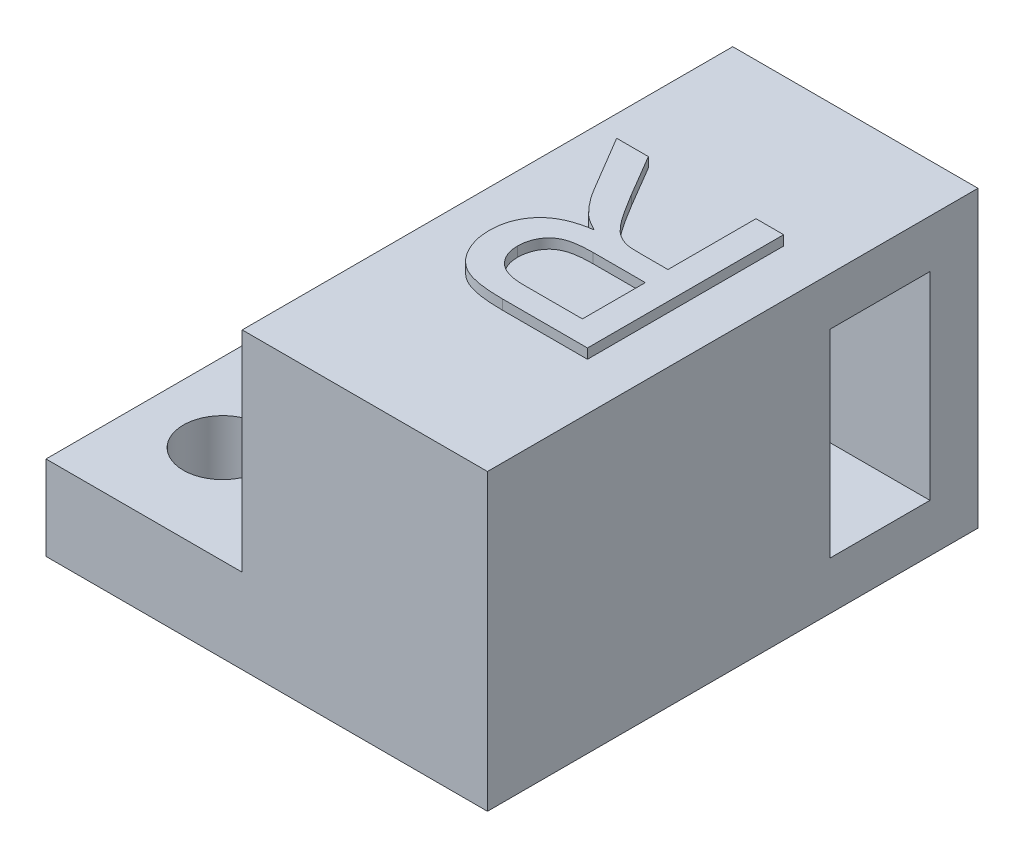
from build123d import *

# Parameters (mm, degrees)
SKETCH1_W           = 25
SKETCH1_H           = 50
BOSS_EXTRUDE1_DEPTH = 30
SKETCH2_W           = 50
SKETCH2_H           = 8.605036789
BOSS_EXTRUDE2_DEPTH = 20
SKETCH3_R           = 4
CUT_EXTRUDE1_DEPTH  = 47.249264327
SKETCH4_W           = 10.2
SKETCH4_H           = 20.2
CUT_EXTRUDE2_DEPTH  = 20
BOSS_EXTRUDE3_DEPTH = 1


with BuildPart() as part:
    # Sketch1 → Boss-Extrude1 (new body)
    with BuildSketch(Plane(origin=(0, 0, 0), x_dir=(1, 0, 0), z_dir=(0, 1, 0))):
        Rectangle(SKETCH1_W, SKETCH1_H)
    extrude(amount=BOSS_EXTRUDE1_DEPTH)

    # Sketch2 → Boss-Extrude2 (add)
    with BuildSketch(Plane.ZY.offset(12.5)):
        with Locations((0, 4.302518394)):
            Rectangle(SKETCH2_W, SKETCH2_H)
    extrude(amount=BOSS_EXTRUDE2_DEPTH)

    # Sketch3 → Cut-Extrude1 (cut, through all)
    with BuildSketch(Plane(origin=(0, 8.605036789, 0), x_dir=(1, 0, 0), z_dir=(0, 1, 0))):
        with Locations(Location((-24.5, 15, 0), (0, 0, 270))):
            Circle(SKETCH3_R)
        with Locations(Location((-24.5, -15, 0), (0, 0, 270))):
            Circle(SKETCH3_R)
    extrude(amount=-CUT_EXTRUDE1_DEPTH, mode=Mode.SUBTRACT)

    # Sketch4 → Cut-Extrude2 (cut)
    with BuildSketch(Plane(origin=(12.5, 0, 0), x_dir=(0, 0, -1), z_dir=(1, 0, 0))):
        with Locations((15, 15)):
            Rectangle(SKETCH4_W, SKETCH4_H)
    extrude(amount=-CUT_EXTRUDE2_DEPTH, mode=Mode.SUBTRACT)

    # Sketch5 → Boss-Extrude3 (add)
    with BuildSketch(Plane(origin=(0, 30, 0), x_dir=(1, 0, 0), z_dir=(0, 1, 0))):
        with BuildLine():
            Line((7.692307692, 10), (7.692307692, -10))
            Line((7.692307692, -10), (-0.985576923, -10))
            add(Edge.make_bspline(
                [(-0.985576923, -10), (-1.189915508, -9.998406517), (-1.585388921, -9.995322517), (-2.158891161, -9.97328499), (-2.692933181, -9.926466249), (-3.190880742, -9.87417544), (-3.651881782, -9.796967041), (-4.076156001, -9.706387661), (-4.462076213, -9.599333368), (-4.812578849, -9.472790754), (-5.13779529, -9.329673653), (-5.439160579, -9.1529927), (-5.729614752, -8.959721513), (-5.997579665, -8.730765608), (-6.255124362, -8.484777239), (-6.491466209, -8.20944831), (-6.713599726, -7.911670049), (-6.98368474, -7.480457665), (-7.26734754, -6.902448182), (-7.511671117, -6.168093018), (-7.667028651, -5.399134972), (-7.683798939, -4.873873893), (-7.692307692, -4.607371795)],
                knots=[0, 0, 0, 0, 1.242075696, 2.40389213, 3.487198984, 4.500157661, 5.446319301, 6.326791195, 7.136300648, 7.878370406, 8.590488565, 9.292260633, 9.999224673, 10.708050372, 11.431369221, 12.162165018, 12.910600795, 13.687589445, 15.252257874, 16.810406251, 18.381693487, 20, 20, 20, 20], degree=3))
            add(Edge.make_bspline(
                [(-7.692307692, -4.607371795), (-7.688394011, -4.436288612), (-7.680664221, -4.098387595), (-7.621454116, -3.601582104), (-7.51431592, -3.126906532), (-7.376939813, -2.670193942), (-7.1888858, -2.237951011), (-6.971132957, -1.821215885), (-6.700987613, -1.431932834), (-6.399355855, -1.057091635), (-6.048612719, -0.71360816), (-5.658467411, -0.39614679), (-5.217190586, -0.123711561), (-4.739255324, 0.129469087), (-4.212344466, 0.337396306), (-3.644404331, 0.520482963), (-3.031039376, 0.661647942), (-2.605906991, 0.732754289), (-2.387820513, 0.769230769)],
                knots=[0, 0, 0, 0, 0.982645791, 1.940792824, 2.867691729, 3.775150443, 4.675643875, 5.571354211, 6.471357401, 7.392684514, 8.331098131, 9.285922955, 10.275520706, 11.304845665, 12.388884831, 13.524255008, 14.729980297, 16, 16, 16, 16], degree=3))
            add(Edge.make_bspline(
                [(-2.387820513, 0.769230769), (-2.549345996, 0.849743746), (-2.855664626, 1.002429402), (-3.272498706, 1.255059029), (-3.637663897, 1.492888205), (-3.845092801, 1.671226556), (-3.942307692, 1.754807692)],
                knots=[0, 0, 0, 0, 1.172551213, 2.223638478, 3.167479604, 4, 4, 4, 4], degree=3))
            add(Edge.make_bspline(
                [(-3.942307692, 1.754807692), (-4.131560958, 1.939760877), (-4.519688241, 2.319069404), (-5.049338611, 2.971134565), (-5.573421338, 3.688219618), (-5.888069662, 4.2107727), (-6.049679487, 4.479166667)],
                knots=[0, 0, 0, 0, 0.918170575, 1.883016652, 2.912673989, 4, 4, 4, 4], degree=3))
            Line((-6.049679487, 4.479166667), (-9.330929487, 10))
            Line((-9.330929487, 10), (-6.09775641, 10))
            Line((-6.09775641, 10), (-3.605769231, 5.77724359))
            add(Edge.make_bspline(
                [(-3.605769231, 5.77724359), (-3.516164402, 5.629086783), (-3.342524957, 5.34198322), (-3.091798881, 4.922621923), (-2.845639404, 4.536751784), (-2.618440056, 4.172360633), (-2.395792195, 3.839058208), (-2.196203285, 3.524230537), (-1.99576396, 3.245712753), (-1.765615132, 2.91110533), (-1.484546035, 2.549334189), (-1.156558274, 2.177690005), (-0.854995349, 1.869836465), (-0.473923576, 1.576103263), (-8.0808e-05, 1.307161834), (0.399436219, 1.179583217), (0.592948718, 1.117788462)],
                knots=[0, 0, 0, 0, 1.130591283, 2.190900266, 3.190104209, 4.119071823, 4.994606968, 5.807262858, 6.55236009, 7.234593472, 8.459046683, 9.540234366, 10.471327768, 11.266723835, 12.676093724, 14, 14, 14, 14], degree=3))
            add(Edge.make_bspline(
                [(0.592948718, 1.117788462), (0.674242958, 1.103128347), (0.859840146, 1.069658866), (1.174983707, 1.047799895), (1.556818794, 1.024599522), (1.833541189, 1.025275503), (1.983173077, 1.025641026)],
                knots=[0, 0, 0, 0, 0.709978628, 1.620902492, 2.713552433, 4, 4, 4, 4], degree=3))
            Line((1.983173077, 1.025641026), (4.871794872, 1.025641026))
            Line((4.871794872, 1.025641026), (4.871794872, 10))
            Line((4.871794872, 10), (7.692307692, 10))
        make_face()
        with BuildLine():
            Line((4.871794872, -1.282051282), (-0.484775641, -1.282051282))
            add(Edge.make_bspline(
                [(-0.484775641, -1.282051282), (-0.753386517, -1.286217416), (-1.255529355, -1.294005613), (-1.957518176, -1.361528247), (-2.558000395, -1.467075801), (-3.064646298, -1.627384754), (-3.490432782, -1.842070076), (-3.859462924, -2.104609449), (-4.169752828, -2.430321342), (-4.424939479, -2.80379836), (-4.624425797, -3.210810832), (-4.763816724, -3.641583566), (-4.857398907, -4.087856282), (-4.866967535, -4.393220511), (-4.871794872, -4.547275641)],
                knots=[0, 0, 0, 0, 1.546056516, 2.890207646, 4.055830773, 5.050253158, 5.937355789, 6.790906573, 7.644595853, 8.512568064, 9.38593768, 10.244184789, 11.114197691, 12, 12, 12, 12], degree=3))
            add(Edge.make_bspline(
                [(-4.871794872, -4.547275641), (-4.868088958, -4.659544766), (-4.86083016, -4.879447), (-4.822372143, -5.202097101), (-4.749202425, -5.50786025), (-4.648165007, -5.798940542), (-4.520236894, -6.075969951), (-4.363033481, -6.337858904), (-4.177365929, -6.583269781), (-3.964383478, -6.81341075), (-3.719926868, -7.02284832), (-3.440676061, -7.203538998), (-3.128860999, -7.357089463), (-2.784111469, -7.478956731), (-2.407515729, -7.576430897), (-1.996929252, -7.641277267), (-1.554229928, -7.688199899), (-1.24746496, -7.690912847), (-1.08974359, -7.692307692)],
                knots=[0, 0, 0, 0, 0.965235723, 1.89061323, 2.787065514, 3.661873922, 4.534873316, 5.404925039, 6.281839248, 7.175200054, 8.095223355, 9.040740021, 10.02630299, 11.075573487, 12.177989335, 13.364883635, 14.645170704, 16, 16, 16, 16], degree=3))
            Line((-1.08974359, -7.692307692), (4.871794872, -7.692307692))
            Line((4.871794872, -7.692307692), (4.871794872, -1.282051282))
        make_face(mode=Mode.SUBTRACT)
    extrude(amount=BOSS_EXTRUDE3_DEPTH)


solid = part.part
